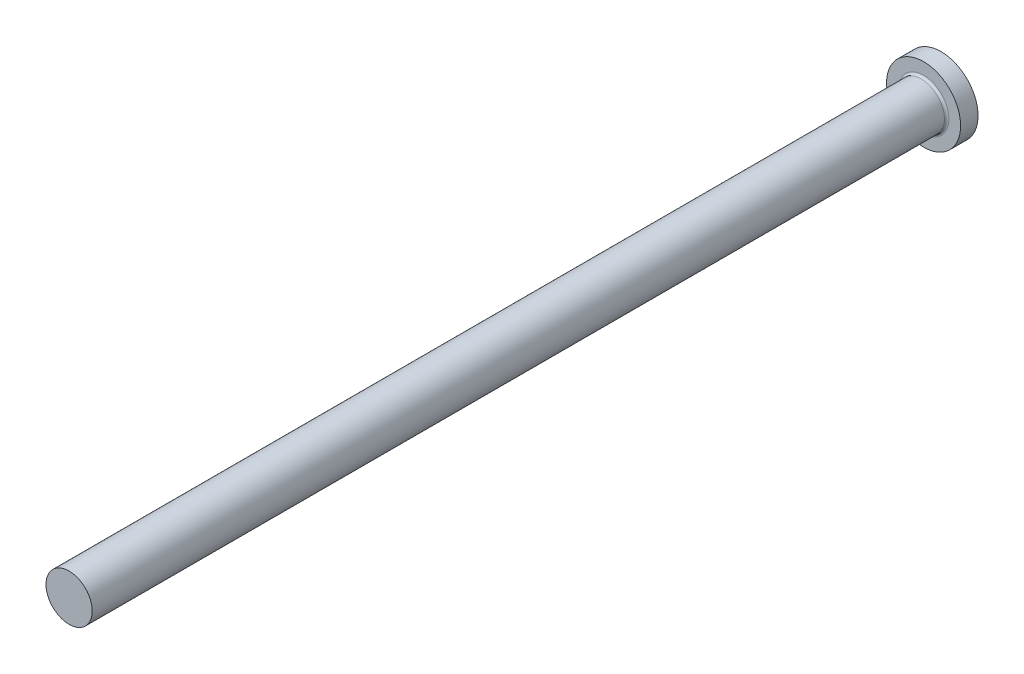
ISO-10303-21;
HEADER;
FILE_DESCRIPTION(('STEP AP214'),'2;1');
FILE_NAME('part.step','',(''),(''),'','','');
FILE_SCHEMA(('AUTOMOTIVE_DESIGN { 1 0 10303 214 1 1 1 1 }'));
ENDSEC;
DATA;
#1=APPLICATION_CONTEXT('core data for automotive mechanical design processes');
#2=APPLICATION_PROTOCOL_DEFINITION('international standard','automotive_design',2000,#1);
#3=PRODUCT_CONTEXT('',#1,'mechanical');
#4=PRODUCT('Part','Part','',(#3));
#5=PRODUCT_RELATED_PRODUCT_CATEGORY('part','',(#4));
#6=PRODUCT_DEFINITION_FORMATION('','',#4);
#7=PRODUCT_DEFINITION_CONTEXT('part definition',#1,'design');
#8=PRODUCT_DEFINITION('design','',#6,#7);
#9=PRODUCT_DEFINITION_SHAPE('','',#8);
#10=(LENGTH_UNIT() NAMED_UNIT(*) SI_UNIT(.MILLI.,.METRE.));
#11=(NAMED_UNIT(*) PLANE_ANGLE_UNIT() SI_UNIT($,.RADIAN.));
#12=(NAMED_UNIT(*) SI_UNIT($,.STERADIAN.) SOLID_ANGLE_UNIT());
#13=UNCERTAINTY_MEASURE_WITH_UNIT(LENGTH_MEASURE(1.E-05),#10,'distance_accuracy_value','');
#14=(GEOMETRIC_REPRESENTATION_CONTEXT(3) GLOBAL_UNCERTAINTY_ASSIGNED_CONTEXT((#13)) GLOBAL_UNIT_ASSIGNED_CONTEXT((#10,
#11,#12)) REPRESENTATION_CONTEXT('',''));
#15=CARTESIAN_POINT('',(0.,0.,0.));
#16=DIRECTION('',(0.,0.,1.));
#17=DIRECTION('',(1.,0.,0.));
#18=AXIS2_PLACEMENT_3D('',#15,#16,#17);
#19=CARTESIAN_POINT('',(8.5,0.,4.));
#20=DIRECTION('',(0.,0.,-1.));
#21=DIRECTION('',(-1.,0.,0.));
#22=AXIS2_PLACEMENT_3D('',#19,#20,#21);
#23=PLANE('',#22);
#24=CARTESIAN_POINT('',(0.,0.,4.));
#25=DIRECTION('',(0.,0.,-1.));
#26=DIRECTION('',(-1.,0.,0.));
#27=AXIS2_PLACEMENT_3D('',#24,#25,#26);
#28=CIRCLE('',#27,5.80000000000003);
#29=CARTESIAN_POINT('',(-5.80000000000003,0.,4.));
#30=VERTEX_POINT('',#29);
#31=EDGE_CURVE('E40',#30,#30,#28,.T.);
#32=ORIENTED_EDGE('',*,*,#31,.T.);
#33=EDGE_LOOP('',(#32));
#34=FACE_BOUND('',#33,.T.);
#35=CARTESIAN_POINT('',(0.,0.,4.));
#36=DIRECTION('',(0.,0.,-1.));
#37=DIRECTION('',(-1.,0.,0.));
#38=AXIS2_PLACEMENT_3D('',#35,#36,#37);
#39=CIRCLE('',#38,8.5);
#40=CARTESIAN_POINT('',(-8.5,0.,4.));
#41=VERTEX_POINT('',#40);
#42=EDGE_CURVE('E44',#41,#41,#39,.T.);
#43=ORIENTED_EDGE('',*,*,#42,.F.);
#44=EDGE_LOOP('',(#43));
#45=FACE_BOUND('',#44,.T.);
#46=ADVANCED_FACE('F33',(#34,#45),#23,.F.);
#47=CARTESIAN_POINT('',(0.,0.,-9.03322817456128));
#48=DIRECTION('',(0.,0.,-1.));
#49=DIRECTION('',(-1.,0.,0.));
#50=AXIS2_PLACEMENT_3D('',#47,#48,#49);
#51=CYLINDRICAL_SURFACE('',#50,8.5);
#52=CARTESIAN_POINT('',(0.,0.,0.));
#53=DIRECTION('',(0.,0.,-1.));
#54=DIRECTION('',(-1.,0.,0.));
#55=AXIS2_PLACEMENT_3D('',#52,#53,#54);
#56=CIRCLE('',#55,8.5);
#57=CARTESIAN_POINT('',(-8.5,0.,0.));
#58=VERTEX_POINT('',#57);
#59=EDGE_CURVE('E48',#58,#58,#56,.T.);
#60=ORIENTED_EDGE('',*,*,#59,.F.);
#61=EDGE_LOOP('',(#60));
#62=FACE_BOUND('',#61,.T.);
#63=ORIENTED_EDGE('',*,*,#42,.T.);
#64=EDGE_LOOP('',(#63));
#65=FACE_BOUND('',#64,.T.);
#66=ADVANCED_FACE('F68',(#62,#65),#51,.T.);
#67=CARTESIAN_POINT('',(0.,0.,0.));
#68=DIRECTION('',(0.,0.,1.));
#69=DIRECTION('',(1.,0.,0.));
#70=AXIS2_PLACEMENT_3D('',#67,#68,#69);
#71=PLANE('',#70);
#72=ORIENTED_EDGE('',*,*,#59,.T.);
#73=EDGE_LOOP('',(#72));
#74=FACE_BOUND('',#73,.T.);
#75=ADVANCED_FACE('F61',(#74),#71,.F.);
#76=CARTESIAN_POINT('',(0.,0.,200.));
#77=DIRECTION('',(0.,0.,-1.));
#78=DIRECTION('',(-1.,0.,0.));
#79=AXIS2_PLACEMENT_3D('',#76,#77,#78);
#80=PLANE('',#79);
#81=CARTESIAN_POINT('',(0.,0.,200.));
#82=DIRECTION('',(0.,0.,-1.));
#83=DIRECTION('',(-1.,0.,0.));
#84=AXIS2_PLACEMENT_3D('',#81,#82,#83);
#85=CIRCLE('',#84,5.30000000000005);
#86=CARTESIAN_POINT('',(-5.30000000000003,0.,200.));
#87=VERTEX_POINT('',#86);
#88=EDGE_CURVE('E53',#87,#87,#85,.T.);
#89=ORIENTED_EDGE('',*,*,#88,.F.);
#90=EDGE_LOOP('',(#89));
#91=FACE_BOUND('',#90,.T.);
#92=ADVANCED_FACE('F59',(#91),#80,.F.);
#93=CARTESIAN_POINT('',(0.,0.,-9.03322817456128));
#94=DIRECTION('',(0.,0.,-1.));
#95=DIRECTION('',(-1.,0.,0.));
#96=AXIS2_PLACEMENT_3D('',#93,#94,#95);
#97=CYLINDRICAL_SURFACE('',#96,5.30000000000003);
#98=CARTESIAN_POINT('',(0.,0.,4.5));
#99=DIRECTION('',(0.,0.,-1.));
#100=DIRECTION('',(-1.,0.,0.));
#101=AXIS2_PLACEMENT_3D('',#98,#99,#100);
#102=CIRCLE('',#101,5.30000000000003);
#103=CARTESIAN_POINT('',(-5.30000000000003,0.,4.5));
#104=VERTEX_POINT('',#103);
#105=EDGE_CURVE('E10',#104,#104,#102,.F.);
#106=ORIENTED_EDGE('',*,*,#105,.T.);
#107=EDGE_LOOP('',(#106));
#108=FACE_BOUND('',#107,.T.);
#109=ORIENTED_EDGE('',*,*,#88,.T.);
#110=EDGE_LOOP('',(#109));
#111=FACE_BOUND('',#110,.T.);
#112=ADVANCED_FACE('F57',(#108,#111),#97,.T.);
#113=CARTESIAN_POINT('',(0.,0.,4.5));
#114=DIRECTION('',(0.,0.,-1.));
#115=DIRECTION('',(-1.,0.,0.));
#116=AXIS2_PLACEMENT_3D('',#113,#114,#115);
#117=TOROIDAL_SURFACE('',#116,5.80000000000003,0.5);
#118=ORIENTED_EDGE('',*,*,#105,.F.);
#119=EDGE_LOOP('',(#118));
#120=FACE_BOUND('',#119,.T.);
#121=ORIENTED_EDGE('',*,*,#31,.F.);
#122=EDGE_LOOP('',(#121));
#123=FACE_BOUND('',#122,.T.);
#124=ADVANCED_FACE('F35',(#120,#123),#117,.F.);
#125=CLOSED_SHELL('',(#46,#66,#75,#92,#112,#124));
#126=MANIFOLD_SOLID_BREP('B2',#125);
#127=ADVANCED_BREP_SHAPE_REPRESENTATION('',(#18,#126),#14);
#128=SHAPE_DEFINITION_REPRESENTATION(#9,#127);
ENDSEC;
END-ISO-10303-21;
